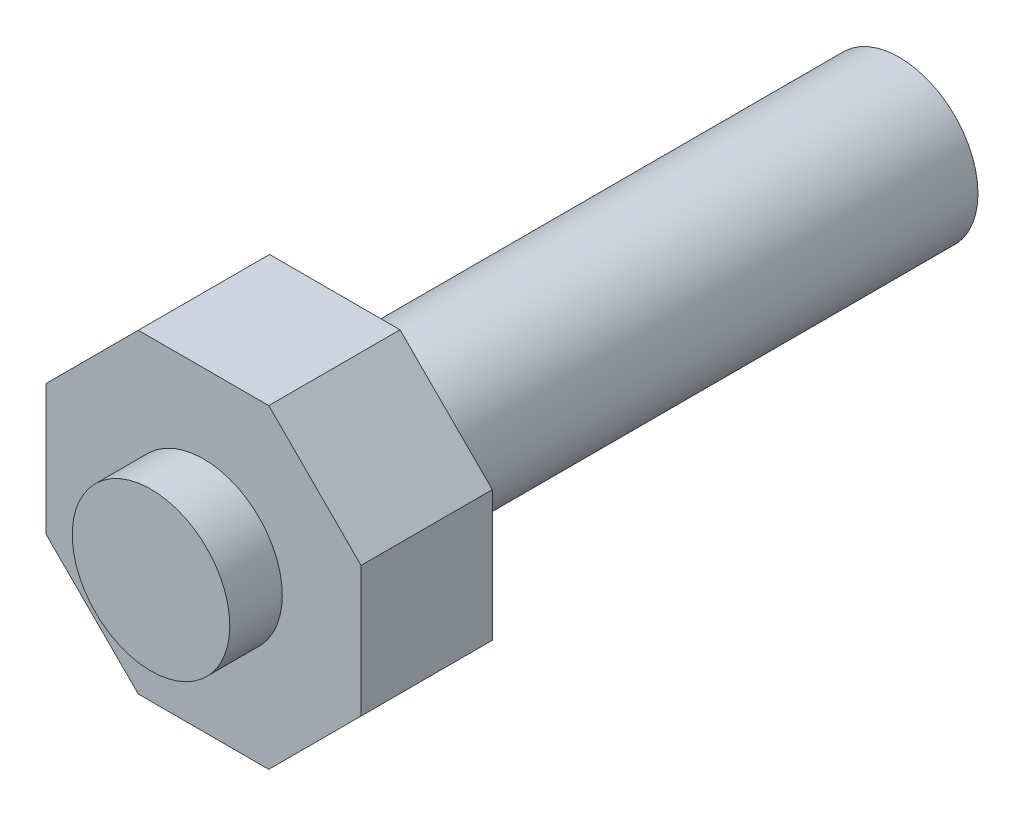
ISO-10303-21;
HEADER;
FILE_DESCRIPTION(('STEP AP214'),'2;1');
FILE_NAME('part.step','',(''),(''),'','','');
FILE_SCHEMA(('AUTOMOTIVE_DESIGN { 1 0 10303 214 1 1 1 1 }'));
ENDSEC;
DATA;
#1=APPLICATION_CONTEXT('core data for automotive mechanical design processes');
#2=APPLICATION_PROTOCOL_DEFINITION('international standard','automotive_design',2000,#1);
#3=PRODUCT_CONTEXT('',#1,'mechanical');
#4=PRODUCT('Part','Part','',(#3));
#5=PRODUCT_RELATED_PRODUCT_CATEGORY('part','',(#4));
#6=PRODUCT_DEFINITION_FORMATION('','',#4);
#7=PRODUCT_DEFINITION_CONTEXT('part definition',#1,'design');
#8=PRODUCT_DEFINITION('design','',#6,#7);
#9=PRODUCT_DEFINITION_SHAPE('','',#8);
#10=(LENGTH_UNIT() NAMED_UNIT(*) SI_UNIT(.MILLI.,.METRE.));
#11=(NAMED_UNIT(*) PLANE_ANGLE_UNIT() SI_UNIT($,.RADIAN.));
#12=(NAMED_UNIT(*) SI_UNIT($,.STERADIAN.) SOLID_ANGLE_UNIT());
#13=UNCERTAINTY_MEASURE_WITH_UNIT(LENGTH_MEASURE(1.E-05),#10,'distance_accuracy_value','');
#14=(GEOMETRIC_REPRESENTATION_CONTEXT(3) GLOBAL_UNCERTAINTY_ASSIGNED_CONTEXT((#13)) GLOBAL_UNIT_ASSIGNED_CONTEXT((#10,
#11,#12)) REPRESENTATION_CONTEXT('',''));
#15=CARTESIAN_POINT('',(0.,0.,0.));
#16=DIRECTION('',(0.,0.,1.));
#17=DIRECTION('',(1.,0.,0.));
#18=AXIS2_PLACEMENT_3D('',#15,#16,#17);
#19=CARTESIAN_POINT('',(6.,0.,43.));
#20=DIRECTION('',(0.,0.,1.));
#21=DIRECTION('',(1.,0.,0.));
#22=AXIS2_PLACEMENT_3D('',#19,#20,#21);
#23=PLANE('',#22);
#24=CARTESIAN_POINT('',(0.,0.,43.));
#25=DIRECTION('',(0.,0.,1.));
#26=DIRECTION('',(1.,0.,0.));
#27=AXIS2_PLACEMENT_3D('',#24,#25,#26);
#28=CIRCLE('',#27,6.);
#29=CARTESIAN_POINT('',(6.,0.,43.));
#30=VERTEX_POINT('',#29);
#31=EDGE_CURVE('E22',#30,#30,#28,.T.);
#32=ORIENTED_EDGE('',*,*,#31,.T.);
#33=EDGE_LOOP('',(#32));
#34=FACE_BOUND('',#33,.T.);
#35=DIRECTION('',(-0.707106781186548,-0.707106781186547,0.));
#36=VECTOR('',#35,1.);
#37=CARTESIAN_POINT('',(12.,-4.97056274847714,43.));
#38=LINE('',#37,#36);
#39=CARTESIAN_POINT('',(12.,-4.97056274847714,43.));
#40=VERTEX_POINT('',#39);
#41=CARTESIAN_POINT('',(4.97056274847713,-12.,43.));
#42=VERTEX_POINT('',#41);
#43=EDGE_CURVE('E91',#40,#42,#38,.T.);
#44=ORIENTED_EDGE('',*,*,#43,.T.);
#45=DIRECTION('',(1.,0.,0.));
#46=VECTOR('',#45,1.);
#47=CARTESIAN_POINT('',(-4.97056274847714,-12.,43.));
#48=LINE('',#47,#46);
#49=CARTESIAN_POINT('',(-4.97056274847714,-12.,43.));
#50=VERTEX_POINT('',#49);
#51=EDGE_CURVE('E97',#50,#42,#48,.T.);
#52=ORIENTED_EDGE('',*,*,#51,.F.);
#53=DIRECTION('',(0.707106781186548,-0.707106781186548,0.));
#54=VECTOR('',#53,1.);
#55=CARTESIAN_POINT('',(-12.,-4.97056274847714,43.));
#56=LINE('',#55,#54);
#57=CARTESIAN_POINT('',(-12.,-4.97056274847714,43.));
#58=VERTEX_POINT('',#57);
#59=EDGE_CURVE('E29',#58,#50,#56,.T.);
#60=ORIENTED_EDGE('',*,*,#59,.F.);
#61=DIRECTION('',(0.,-1.,0.));
#62=VECTOR('',#61,1.);
#63=CARTESIAN_POINT('',(-12.,4.97056274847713,43.));
#64=LINE('',#63,#62);
#65=CARTESIAN_POINT('',(-12.,4.97056274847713,43.));
#66=VERTEX_POINT('',#65);
#67=EDGE_CURVE('E111',#66,#58,#64,.T.);
#68=ORIENTED_EDGE('',*,*,#67,.F.);
#69=DIRECTION('',(0.707106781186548,0.707106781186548,0.));
#70=VECTOR('',#69,1.);
#71=CARTESIAN_POINT('',(-12.,4.97056274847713,43.));
#72=LINE('',#71,#70);
#73=CARTESIAN_POINT('',(-4.97056274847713,12.,43.));
#74=VERTEX_POINT('',#73);
#75=EDGE_CURVE('E108',#66,#74,#72,.T.);
#76=ORIENTED_EDGE('',*,*,#75,.T.);
#77=DIRECTION('',(1.,0.,0.));
#78=VECTOR('',#77,1.);
#79=CARTESIAN_POINT('',(-4.97056274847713,12.,43.));
#80=LINE('',#79,#78);
#81=CARTESIAN_POINT('',(4.97056274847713,12.,43.));
#82=VERTEX_POINT('',#81);
#83=EDGE_CURVE('E103',#74,#82,#80,.T.);
#84=ORIENTED_EDGE('',*,*,#83,.T.);
#85=DIRECTION('',(0.707106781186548,-0.707106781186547,0.));
#86=VECTOR('',#85,1.);
#87=CARTESIAN_POINT('',(4.97056274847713,12.,43.));
#88=LINE('',#87,#86);
#89=CARTESIAN_POINT('',(12.,4.97056274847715,43.));
#90=VERTEX_POINT('',#89);
#91=EDGE_CURVE('E101',#82,#90,#88,.T.);
#92=ORIENTED_EDGE('',*,*,#91,.T.);
#93=DIRECTION('',(0.,-1.,0.));
#94=VECTOR('',#93,1.);
#95=CARTESIAN_POINT('',(12.,4.97056274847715,43.));
#96=LINE('',#95,#94);
#97=EDGE_CURVE('E83',#90,#40,#96,.T.);
#98=ORIENTED_EDGE('',*,*,#97,.T.);
#99=EDGE_LOOP('',(#44,#52,#60,#68,#76,#84,#92,#98));
#100=FACE_BOUND('',#99,.T.);
#101=ADVANCED_FACE('F14',(#34,#100),#23,.F.);
#102=CARTESIAN_POINT('',(0.,0.,0.));
#103=DIRECTION('',(0.,0.,1.));
#104=DIRECTION('',(1.,0.,0.));
#105=AXIS2_PLACEMENT_3D('',#102,#103,#104);
#106=PLANE('',#105);
#107=CARTESIAN_POINT('',(0.,0.,0.));
#108=DIRECTION('',(0.,0.,1.));
#109=DIRECTION('',(1.,0.,0.));
#110=AXIS2_PLACEMENT_3D('',#107,#108,#109);
#111=CIRCLE('',#110,6.);
#112=CARTESIAN_POINT('',(6.,0.,0.));
#113=VERTEX_POINT('',#112);
#114=EDGE_CURVE('E9',#113,#113,#111,.T.);
#115=ORIENTED_EDGE('',*,*,#114,.F.);
#116=EDGE_LOOP('',(#115));
#117=FACE_BOUND('',#116,.T.);
#118=ADVANCED_FACE('F16',(#117),#106,.F.);
#119=CARTESIAN_POINT('',(0.,0.,80.));
#120=DIRECTION('',(0.,0.,1.));
#121=DIRECTION('',(1.,0.,0.));
#122=AXIS2_PLACEMENT_3D('',#119,#120,#121);
#123=CYLINDRICAL_SURFACE('',#122,6.);
#124=ORIENTED_EDGE('',*,*,#31,.F.);
#125=EDGE_LOOP('',(#124));
#126=FACE_BOUND('',#125,.T.);
#127=ORIENTED_EDGE('',*,*,#114,.T.);
#128=EDGE_LOOP('',(#127));
#129=FACE_BOUND('',#128,.T.);
#130=ADVANCED_FACE('F155',(#126,#129),#123,.T.);
#131=CARTESIAN_POINT('',(12.,-4.97056274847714,53.));
#132=DIRECTION('',(0.707106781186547,-0.707106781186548,0.));
#133=DIRECTION('',(0.707106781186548,0.707106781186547,0.));
#134=AXIS2_PLACEMENT_3D('',#131,#132,#133);
#135=PLANE('',#134);
#136=DIRECTION('',(0.,0.,-1.));
#137=VECTOR('',#136,1.);
#138=CARTESIAN_POINT('',(12.,-4.97056274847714,53.));
#139=LINE('',#138,#137);
#140=CARTESIAN_POINT('',(12.,-4.97056274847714,53.));
#141=VERTEX_POINT('',#140);
#142=EDGE_CURVE('E79',#141,#40,#139,.T.);
#143=ORIENTED_EDGE('',*,*,#142,.F.);
#144=DIRECTION('',(-0.707106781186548,-0.707106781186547,0.));
#145=VECTOR('',#144,1.);
#146=CARTESIAN_POINT('',(12.,-4.97056274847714,53.));
#147=LINE('',#146,#145);
#148=CARTESIAN_POINT('',(4.97056274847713,-12.,53.));
#149=VERTEX_POINT('',#148);
#150=EDGE_CURVE('E37',#141,#149,#147,.T.);
#151=ORIENTED_EDGE('',*,*,#150,.T.);
#152=DIRECTION('',(0.,0.,-1.));
#153=VECTOR('',#152,1.);
#154=CARTESIAN_POINT('',(4.97056274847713,-12.,53.));
#155=LINE('',#154,#153);
#156=EDGE_CURVE('E93',#149,#42,#155,.T.);
#157=ORIENTED_EDGE('',*,*,#156,.T.);
#158=ORIENTED_EDGE('',*,*,#43,.F.);
#159=EDGE_LOOP('',(#143,#151,#157,#158));
#160=FACE_BOUND('',#159,.T.);
#161=ADVANCED_FACE('F92',(#160),#135,.T.);
#162=CARTESIAN_POINT('',(12.,4.97056274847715,53.));
#163=DIRECTION('',(1.,0.,0.));
#164=DIRECTION('',(0.,0.,-1.));
#165=AXIS2_PLACEMENT_3D('',#162,#163,#164);
#166=PLANE('',#165);
#167=DIRECTION('',(0.,0.,-1.));
#168=VECTOR('',#167,1.);
#169=CARTESIAN_POINT('',(12.,4.97056274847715,53.));
#170=LINE('',#169,#168);
#171=CARTESIAN_POINT('',(12.,4.97056274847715,53.));
#172=VERTEX_POINT('',#171);
#173=EDGE_CURVE('E88',#172,#90,#170,.T.);
#174=ORIENTED_EDGE('',*,*,#173,.F.);
#175=DIRECTION('',(0.,-1.,0.));
#176=VECTOR('',#175,1.);
#177=CARTESIAN_POINT('',(12.,4.97056274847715,53.));
#178=LINE('',#177,#176);
#179=EDGE_CURVE('E86',#172,#141,#178,.T.);
#180=ORIENTED_EDGE('',*,*,#179,.T.);
#181=ORIENTED_EDGE('',*,*,#142,.T.);
#182=ORIENTED_EDGE('',*,*,#97,.F.);
#183=EDGE_LOOP('',(#174,#180,#181,#182));
#184=FACE_BOUND('',#183,.T.);
#185=ADVANCED_FACE('F81',(#184),#166,.T.);
#186=CARTESIAN_POINT('',(4.97056274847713,12.,53.));
#187=DIRECTION('',(0.707106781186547,0.707106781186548,0.));
#188=DIRECTION('',(-0.707106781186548,0.707106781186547,0.));
#189=AXIS2_PLACEMENT_3D('',#186,#187,#188);
#190=PLANE('',#189);
#191=DIRECTION('',(0.,0.,-1.));
#192=VECTOR('',#191,1.);
#193=CARTESIAN_POINT('',(4.97056274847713,12.,53.));
#194=LINE('',#193,#192);
#195=CARTESIAN_POINT('',(4.97056274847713,12.,53.));
#196=VERTEX_POINT('',#195);
#197=EDGE_CURVE('E144',#196,#82,#194,.T.);
#198=ORIENTED_EDGE('',*,*,#197,.F.);
#199=DIRECTION('',(0.707106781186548,-0.707106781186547,0.));
#200=VECTOR('',#199,1.);
#201=CARTESIAN_POINT('',(4.97056274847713,12.,53.));
#202=LINE('',#201,#200);
#203=EDGE_CURVE('E124',#196,#172,#202,.T.);
#204=ORIENTED_EDGE('',*,*,#203,.T.);
#205=ORIENTED_EDGE('',*,*,#173,.T.);
#206=ORIENTED_EDGE('',*,*,#91,.F.);
#207=EDGE_LOOP('',(#198,#204,#205,#206));
#208=FACE_BOUND('',#207,.T.);
#209=ADVANCED_FACE('F186',(#208),#190,.T.);
#210=CARTESIAN_POINT('',(-4.97056274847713,12.,53.));
#211=DIRECTION('',(0.,1.,0.));
#212=DIRECTION('',(0.,0.,1.));
#213=AXIS2_PLACEMENT_3D('',#210,#211,#212);
#214=PLANE('',#213);
#215=DIRECTION('',(0.,0.,-1.));
#216=VECTOR('',#215,1.);
#217=CARTESIAN_POINT('',(-4.97056274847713,12.,53.));
#218=LINE('',#217,#216);
#219=CARTESIAN_POINT('',(-4.97056274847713,12.,53.));
#220=VERTEX_POINT('',#219);
#221=EDGE_CURVE('E142',#220,#74,#218,.T.);
#222=ORIENTED_EDGE('',*,*,#221,.F.);
#223=DIRECTION('',(1.,0.,0.));
#224=VECTOR('',#223,1.);
#225=CARTESIAN_POINT('',(-4.97056274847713,12.,53.));
#226=LINE('',#225,#224);
#227=EDGE_CURVE('E128',#220,#196,#226,.T.);
#228=ORIENTED_EDGE('',*,*,#227,.T.);
#229=ORIENTED_EDGE('',*,*,#197,.T.);
#230=ORIENTED_EDGE('',*,*,#83,.F.);
#231=EDGE_LOOP('',(#222,#228,#229,#230));
#232=FACE_BOUND('',#231,.T.);
#233=ADVANCED_FACE('F189',(#232),#214,.T.);
#234=CARTESIAN_POINT('',(-12.,4.97056274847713,53.));
#235=DIRECTION('',(-0.707106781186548,0.707106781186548,0.));
#236=DIRECTION('',(-0.707106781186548,-0.707106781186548,0.));
#237=AXIS2_PLACEMENT_3D('',#234,#235,#236);
#238=PLANE('',#237);
#239=DIRECTION('',(0.,0.,-1.));
#240=VECTOR('',#239,1.);
#241=CARTESIAN_POINT('',(-12.,4.97056274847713,53.));
#242=LINE('',#241,#240);
#243=CARTESIAN_POINT('',(-12.,4.97056274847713,53.));
#244=VERTEX_POINT('',#243);
#245=EDGE_CURVE('E140',#244,#66,#242,.T.);
#246=ORIENTED_EDGE('',*,*,#245,.F.);
#247=DIRECTION('',(0.707106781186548,0.707106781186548,0.));
#248=VECTOR('',#247,1.);
#249=CARTESIAN_POINT('',(-12.,4.97056274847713,53.));
#250=LINE('',#249,#248);
#251=EDGE_CURVE('E125',#244,#220,#250,.T.);
#252=ORIENTED_EDGE('',*,*,#251,.T.);
#253=ORIENTED_EDGE('',*,*,#221,.T.);
#254=ORIENTED_EDGE('',*,*,#75,.F.);
#255=EDGE_LOOP('',(#246,#252,#253,#254));
#256=FACE_BOUND('',#255,.T.);
#257=ADVANCED_FACE('F193',(#256),#238,.T.);
#258=CARTESIAN_POINT('',(-12.,4.97056274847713,53.));
#259=DIRECTION('',(1.,0.,0.));
#260=DIRECTION('',(0.,1.,0.));
#261=AXIS2_PLACEMENT_3D('',#258,#259,#260);
#262=PLANE('',#261);
#263=DIRECTION('',(0.,0.,-1.));
#264=VECTOR('',#263,1.);
#265=CARTESIAN_POINT('',(-12.,-4.97056274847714,53.));
#266=LINE('',#265,#264);
#267=CARTESIAN_POINT('',(-12.,-4.97056274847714,53.));
#268=VERTEX_POINT('',#267);
#269=EDGE_CURVE('E138',#268,#58,#266,.T.);
#270=ORIENTED_EDGE('',*,*,#269,.F.);
#271=DIRECTION('',(0.,-1.,0.));
#272=VECTOR('',#271,1.);
#273=CARTESIAN_POINT('',(-12.,4.97056274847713,53.));
#274=LINE('',#273,#272);
#275=EDGE_CURVE('E122',#244,#268,#274,.T.);
#276=ORIENTED_EDGE('',*,*,#275,.F.);
#277=ORIENTED_EDGE('',*,*,#245,.T.);
#278=ORIENTED_EDGE('',*,*,#67,.T.);
#279=EDGE_LOOP('',(#270,#276,#277,#278));
#280=FACE_BOUND('',#279,.T.);
#281=ADVANCED_FACE('F197',(#280),#262,.F.);
#282=CARTESIAN_POINT('',(-12.,-4.97056274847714,53.));
#283=DIRECTION('',(0.707106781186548,0.707106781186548,0.));
#284=DIRECTION('',(-0.707106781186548,0.707106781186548,0.));
#285=AXIS2_PLACEMENT_3D('',#282,#283,#284);
#286=PLANE('',#285);
#287=DIRECTION('',(0.,0.,-1.));
#288=VECTOR('',#287,1.);
#289=CARTESIAN_POINT('',(-4.97056274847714,-12.,53.));
#290=LINE('',#289,#288);
#291=CARTESIAN_POINT('',(-4.97056274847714,-12.,53.));
#292=VERTEX_POINT('',#291);
#293=EDGE_CURVE('E136',#292,#50,#290,.T.);
#294=ORIENTED_EDGE('',*,*,#293,.F.);
#295=DIRECTION('',(0.707106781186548,-0.707106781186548,0.));
#296=VECTOR('',#295,1.);
#297=CARTESIAN_POINT('',(-12.,-4.97056274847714,53.));
#298=LINE('',#297,#296);
#299=EDGE_CURVE('E119',#268,#292,#298,.T.);
#300=ORIENTED_EDGE('',*,*,#299,.F.);
#301=ORIENTED_EDGE('',*,*,#269,.T.);
#302=ORIENTED_EDGE('',*,*,#59,.T.);
#303=EDGE_LOOP('',(#294,#300,#301,#302));
#304=FACE_BOUND('',#303,.T.);
#305=ADVANCED_FACE('F201',(#304),#286,.F.);
#306=CARTESIAN_POINT('',(-4.97056274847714,-12.,53.));
#307=DIRECTION('',(0.,1.,0.));
#308=DIRECTION('',(0.,0.,1.));
#309=AXIS2_PLACEMENT_3D('',#306,#307,#308);
#310=PLANE('',#309);
#311=DIRECTION('',(1.,0.,0.));
#312=VECTOR('',#311,1.);
#313=CARTESIAN_POINT('',(-4.97056274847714,-12.,53.));
#314=LINE('',#313,#312);
#315=EDGE_CURVE('E116',#292,#149,#314,.T.);
#316=ORIENTED_EDGE('',*,*,#315,.F.);
#317=ORIENTED_EDGE('',*,*,#293,.T.);
#318=ORIENTED_EDGE('',*,*,#51,.T.);
#319=ORIENTED_EDGE('',*,*,#156,.F.);
#320=EDGE_LOOP('',(#316,#317,#318,#319));
#321=FACE_BOUND('',#320,.T.);
#322=ADVANCED_FACE('F182',(#321),#310,.F.);
#323=CARTESIAN_POINT('',(6.,0.,57.));
#324=DIRECTION('',(0.,0.,-1.));
#325=DIRECTION('',(-1.,0.,0.));
#326=AXIS2_PLACEMENT_3D('',#323,#324,#325);
#327=PLANE('',#326);
#328=CARTESIAN_POINT('',(0.,0.,57.));
#329=DIRECTION('',(0.,0.,1.));
#330=DIRECTION('',(1.,0.,0.));
#331=AXIS2_PLACEMENT_3D('',#328,#329,#330);
#332=CIRCLE('',#331,6.);
#333=CARTESIAN_POINT('',(6.,0.,57.));
#334=VERTEX_POINT('',#333);
#335=EDGE_CURVE('E87',#334,#334,#332,.T.);
#336=ORIENTED_EDGE('',*,*,#335,.T.);
#337=EDGE_LOOP('',(#336));
#338=FACE_BOUND('',#337,.T.);
#339=ADVANCED_FACE('F178',(#338),#327,.F.);
#340=CARTESIAN_POINT('',(0.,0.,80.));
#341=DIRECTION('',(0.,0.,1.));
#342=DIRECTION('',(1.,0.,0.));
#343=AXIS2_PLACEMENT_3D('',#340,#341,#342);
#344=CYLINDRICAL_SURFACE('',#343,6.);
#345=ORIENTED_EDGE('',*,*,#335,.F.);
#346=EDGE_LOOP('',(#345));
#347=FACE_BOUND('',#346,.T.);
#348=CARTESIAN_POINT('',(0.,0.,53.));
#349=DIRECTION('',(0.,0.,1.));
#350=DIRECTION('',(1.,0.,0.));
#351=AXIS2_PLACEMENT_3D('',#348,#349,#350);
#352=CIRCLE('',#351,6.);
#353=CARTESIAN_POINT('',(6.,0.,53.));
#354=VERTEX_POINT('',#353);
#355=EDGE_CURVE('E149',#354,#354,#352,.T.);
#356=ORIENTED_EDGE('',*,*,#355,.T.);
#357=EDGE_LOOP('',(#356));
#358=FACE_BOUND('',#357,.T.);
#359=ADVANCED_FACE('F174',(#347,#358),#344,.T.);
#360=CARTESIAN_POINT('',(14.,0.,53.));
#361=DIRECTION('',(0.,0.,-1.));
#362=DIRECTION('',(-1.,0.,0.));
#363=AXIS2_PLACEMENT_3D('',#360,#361,#362);
#364=PLANE('',#363);
#365=ORIENTED_EDGE('',*,*,#355,.F.);
#366=EDGE_LOOP('',(#365));
#367=FACE_BOUND('',#366,.T.);
#368=ORIENTED_EDGE('',*,*,#150,.F.);
#369=ORIENTED_EDGE('',*,*,#179,.F.);
#370=ORIENTED_EDGE('',*,*,#203,.F.);
#371=ORIENTED_EDGE('',*,*,#227,.F.);
#372=ORIENTED_EDGE('',*,*,#251,.F.);
#373=ORIENTED_EDGE('',*,*,#275,.T.);
#374=ORIENTED_EDGE('',*,*,#299,.T.);
#375=ORIENTED_EDGE('',*,*,#315,.T.);
#376=EDGE_LOOP('',(#368,#369,#370,#371,#372,#373,#374,#375));
#377=FACE_BOUND('',#376,.T.);
#378=ADVANCED_FACE('F171',(#367,#377),#364,.F.);
#379=CLOSED_SHELL('',(#101,#118,#130,#161,#185,#209,#233,#257,#281,#305,#322,#339,#359,#378));
#380=MANIFOLD_SOLID_BREP('B1',#379);
#381=ADVANCED_BREP_SHAPE_REPRESENTATION('',(#18,#380),#14);
#382=SHAPE_DEFINITION_REPRESENTATION(#9,#381);
ENDSEC;
END-ISO-10303-21;
